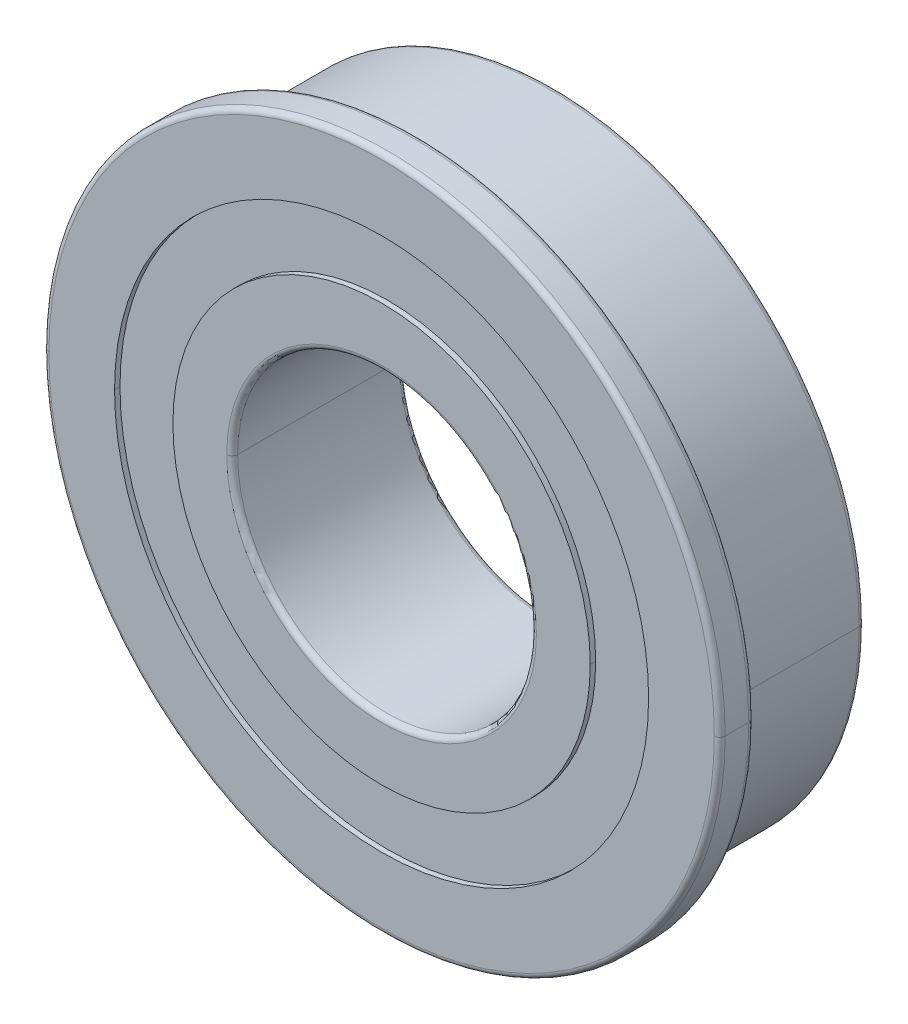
ISO-10303-21;
HEADER;
FILE_DESCRIPTION(('STEP AP214'),'2;1');
FILE_NAME('part.step','',(''),(''),'','','');
FILE_SCHEMA(('AUTOMOTIVE_DESIGN { 1 0 10303 214 1 1 1 1 }'));
ENDSEC;
DATA;
#1=APPLICATION_CONTEXT('core data for automotive mechanical design processes');
#2=APPLICATION_PROTOCOL_DEFINITION('international standard','automotive_design',2000,#1);
#3=PRODUCT_CONTEXT('',#1,'mechanical');
#4=PRODUCT('Part','Part','',(#3));
#5=PRODUCT_RELATED_PRODUCT_CATEGORY('part','',(#4));
#6=PRODUCT_DEFINITION_FORMATION('','',#4);
#7=PRODUCT_DEFINITION_CONTEXT('part definition',#1,'design');
#8=PRODUCT_DEFINITION('design','',#6,#7);
#9=PRODUCT_DEFINITION_SHAPE('','',#8);
#10=(LENGTH_UNIT() NAMED_UNIT(*) SI_UNIT(.MILLI.,.METRE.));
#11=(NAMED_UNIT(*) PLANE_ANGLE_UNIT() SI_UNIT($,.RADIAN.));
#12=(NAMED_UNIT(*) SI_UNIT($,.STERADIAN.) SOLID_ANGLE_UNIT());
#13=UNCERTAINTY_MEASURE_WITH_UNIT(LENGTH_MEASURE(1.E-05),#10,'distance_accuracy_value','');
#14=(GEOMETRIC_REPRESENTATION_CONTEXT(3) GLOBAL_UNCERTAINTY_ASSIGNED_CONTEXT((#13)) GLOBAL_UNIT_ASSIGNED_CONTEXT((#10,
#11,#12)) REPRESENTATION_CONTEXT('',''));
#15=CARTESIAN_POINT('',(0.,0.,0.));
#16=DIRECTION('',(0.,0.,1.));
#17=DIRECTION('',(1.,0.,0.));
#18=AXIS2_PLACEMENT_3D('',#15,#16,#17);
#19=CARTESIAN_POINT('',(0.,0.,3.71875));
#20=DIRECTION('',(0.,0.,-1.));
#21=DIRECTION('',(-1.,0.,0.));
#22=AXIS2_PLACEMENT_3D('',#19,#20,#21);
#23=TOROIDAL_SURFACE('',#22,15.31,0.25);
#24=CARTESIAN_POINT('',(15.31,0.,3.71875));
#25=DIRECTION('',(0.,1.,0.));
#26=DIRECTION('',(-1.,0.,0.));
#27=AXIS2_PLACEMENT_3D('',#24,#25,#26);
#28=CIRCLE('',#27,0.25);
#29=CARTESIAN_POINT('',(15.31,0.,3.96875));
#30=VERTEX_POINT('',#29);
#31=CARTESIAN_POINT('',(15.56,0.,3.71875));
#32=VERTEX_POINT('',#31);
#33=EDGE_CURVE('E416',#30,#32,#28,.T.);
#34=ORIENTED_EDGE('',*,*,#33,.F.);
#35=CARTESIAN_POINT('',(0.,0.,3.96875));
#36=DIRECTION('',(0.,0.,1.));
#37=DIRECTION('',(-1.,0.,0.));
#38=AXIS2_PLACEMENT_3D('',#35,#36,#37);
#39=CIRCLE('',#38,15.31);
#40=CARTESIAN_POINT('',(-15.31,0.,3.96875));
#41=VERTEX_POINT('',#40);
#42=EDGE_CURVE('E445',#41,#30,#39,.T.);
#43=ORIENTED_EDGE('',*,*,#42,.F.);
#44=CARTESIAN_POINT('',(-15.31,0.,3.71875));
#45=DIRECTION('',(0.,-1.,0.));
#46=DIRECTION('',(0.,0.,-1.));
#47=AXIS2_PLACEMENT_3D('',#44,#45,#46);
#48=CIRCLE('',#47,0.25);
#49=CARTESIAN_POINT('',(-15.56,0.,3.71875));
#50=VERTEX_POINT('',#49);
#51=EDGE_CURVE('E338',#41,#50,#48,.T.);
#52=ORIENTED_EDGE('',*,*,#51,.T.);
#53=CARTESIAN_POINT('',(0.,0.,3.71875));
#54=DIRECTION('',(0.,0.,-1.));
#55=DIRECTION('',(-1.,0.,0.));
#56=AXIS2_PLACEMENT_3D('',#53,#54,#55);
#57=CIRCLE('',#56,15.56);
#58=EDGE_CURVE('E204',#32,#50,#57,.T.);
#59=ORIENTED_EDGE('',*,*,#58,.F.);
#60=EDGE_LOOP('',(#34,#43,#52,#59));
#61=FACE_BOUND('',#60,.T.);
#62=ADVANCED_FACE('F15',(#61),#23,.T.);
#63=CARTESIAN_POINT('',(0.,0.,-3.71875));
#64=DIRECTION('',(0.,0.,1.));
#65=DIRECTION('',(1.,0.,0.));
#66=AXIS2_PLACEMENT_3D('',#63,#64,#65);
#67=TOROIDAL_SURFACE('',#66,14.0375,0.25);
#68=CARTESIAN_POINT('',(-14.0375,0.,-3.71875));
#69=DIRECTION('',(0.,1.,0.));
#70=DIRECTION('',(-1.,0.,0.));
#71=AXIS2_PLACEMENT_3D('',#68,#69,#70);
#72=CIRCLE('',#71,0.25);
#73=CARTESIAN_POINT('',(-14.0375,0.,-3.96875));
#74=VERTEX_POINT('',#73);
#75=CARTESIAN_POINT('',(-14.2875,0.,-3.71875));
#76=VERTEX_POINT('',#75);
#77=EDGE_CURVE('E278',#74,#76,#72,.T.);
#78=ORIENTED_EDGE('',*,*,#77,.F.);
#79=CARTESIAN_POINT('',(0.,0.,-3.96875));
#80=DIRECTION('',(0.,0.,-1.));
#81=DIRECTION('',(1.,0.,0.));
#82=AXIS2_PLACEMENT_3D('',#79,#80,#81);
#83=CIRCLE('',#82,14.0375);
#84=CARTESIAN_POINT('',(14.0375,0.,-3.96875));
#85=VERTEX_POINT('',#84);
#86=EDGE_CURVE('E191',#85,#74,#83,.T.);
#87=ORIENTED_EDGE('',*,*,#86,.F.);
#88=CARTESIAN_POINT('',(14.0375,0.,-3.71875));
#89=DIRECTION('',(0.,-1.,0.));
#90=DIRECTION('',(0.,0.,-1.));
#91=AXIS2_PLACEMENT_3D('',#88,#89,#90);
#92=CIRCLE('',#91,0.25);
#93=CARTESIAN_POINT('',(14.2875,0.,-3.71875));
#94=VERTEX_POINT('',#93);
#95=EDGE_CURVE('E277',#85,#94,#92,.T.);
#96=ORIENTED_EDGE('',*,*,#95,.T.);
#97=CARTESIAN_POINT('',(0.,0.,-3.71875));
#98=DIRECTION('',(0.,0.,1.));
#99=DIRECTION('',(1.,0.,0.));
#100=AXIS2_PLACEMENT_3D('',#97,#98,#99);
#101=CIRCLE('',#100,14.2875);
#102=EDGE_CURVE('E240',#76,#94,#101,.T.);
#103=ORIENTED_EDGE('',*,*,#102,.F.);
#104=EDGE_LOOP('',(#78,#87,#96,#103));
#105=FACE_BOUND('',#104,.T.);
#106=ADVANCED_FACE('F526',(#105),#67,.T.);
#107=CARTESIAN_POINT('',(0.,0.,2.63125));
#108=DIRECTION('',(0.,0.,1.));
#109=DIRECTION('',(1.,0.,0.));
#110=AXIS2_PLACEMENT_3D('',#107,#108,#109);
#111=TOROIDAL_SURFACE('',#110,15.31,0.25);
#112=CARTESIAN_POINT('',(-15.31,0.,2.63125));
#113=DIRECTION('',(0.,1.,0.));
#114=DIRECTION('',(-1.,0.,0.));
#115=AXIS2_PLACEMENT_3D('',#112,#113,#114);
#116=CIRCLE('',#115,0.25);
#117=CARTESIAN_POINT('',(-15.31,0.,2.38125));
#118=VERTEX_POINT('',#117);
#119=CARTESIAN_POINT('',(-15.56,0.,2.63125));
#120=VERTEX_POINT('',#119);
#121=EDGE_CURVE('E313',#118,#120,#116,.T.);
#122=ORIENTED_EDGE('',*,*,#121,.F.);
#123=CARTESIAN_POINT('',(0.,0.,2.38125));
#124=DIRECTION('',(0.,0.,-1.));
#125=DIRECTION('',(1.,0.,0.));
#126=AXIS2_PLACEMENT_3D('',#123,#124,#125);
#127=CIRCLE('',#126,15.31);
#128=CARTESIAN_POINT('',(15.31,0.,2.38125));
#129=VERTEX_POINT('',#128);
#130=EDGE_CURVE('E239',#129,#118,#127,.T.);
#131=ORIENTED_EDGE('',*,*,#130,.F.);
#132=CARTESIAN_POINT('',(15.31,0.,2.63125));
#133=DIRECTION('',(0.,-1.,0.));
#134=DIRECTION('',(0.,0.,-1.));
#135=AXIS2_PLACEMENT_3D('',#132,#133,#134);
#136=CIRCLE('',#135,0.25);
#137=CARTESIAN_POINT('',(15.56,0.,2.63125));
#138=VERTEX_POINT('',#137);
#139=EDGE_CURVE('E287',#129,#138,#136,.T.);
#140=ORIENTED_EDGE('',*,*,#139,.T.);
#141=CARTESIAN_POINT('',(0.,0.,2.63125));
#142=DIRECTION('',(0.,0.,1.));
#143=DIRECTION('',(1.,0.,0.));
#144=AXIS2_PLACEMENT_3D('',#141,#142,#143);
#145=CIRCLE('',#144,15.56);
#146=EDGE_CURVE('E323',#120,#138,#145,.T.);
#147=ORIENTED_EDGE('',*,*,#146,.F.);
#148=EDGE_LOOP('',(#122,#131,#140,#147));
#149=FACE_BOUND('',#148,.T.);
#150=ADVANCED_FACE('F531',(#149),#111,.T.);
#151=CARTESIAN_POINT('',(0.,0.,3.71875));
#152=DIRECTION('',(0.,0.,-1.));
#153=DIRECTION('',(-1.,0.,0.));
#154=AXIS2_PLACEMENT_3D('',#151,#152,#153);
#155=TOROIDAL_SURFACE('',#154,7.125,0.25);
#156=CARTESIAN_POINT('',(7.125,0.,3.71875));
#157=DIRECTION('',(0.,1.,0.));
#158=DIRECTION('',(-1.,0.,0.));
#159=AXIS2_PLACEMENT_3D('',#156,#157,#158);
#160=CIRCLE('',#159,0.25);
#161=CARTESIAN_POINT('',(6.875,0.,3.71875));
#162=VERTEX_POINT('',#161);
#163=CARTESIAN_POINT('',(7.125,0.,3.96875));
#164=VERTEX_POINT('',#163);
#165=EDGE_CURVE('E342',#162,#164,#160,.T.);
#166=ORIENTED_EDGE('',*,*,#165,.F.);
#167=CARTESIAN_POINT('',(0.,0.,3.71875));
#168=DIRECTION('',(0.,0.,1.));
#169=DIRECTION('',(-1.,0.,0.));
#170=AXIS2_PLACEMENT_3D('',#167,#168,#169);
#171=CIRCLE('',#170,6.875);
#172=CARTESIAN_POINT('',(-6.875,0.,3.71875));
#173=VERTEX_POINT('',#172);
#174=EDGE_CURVE('E302',#173,#162,#171,.T.);
#175=ORIENTED_EDGE('',*,*,#174,.F.);
#176=CARTESIAN_POINT('',(-7.125,0.,3.71875));
#177=DIRECTION('',(0.,-1.,0.));
#178=DIRECTION('',(0.,0.,-1.));
#179=AXIS2_PLACEMENT_3D('',#176,#177,#178);
#180=CIRCLE('',#179,0.25);
#181=CARTESIAN_POINT('',(-7.125,0.,3.96875));
#182=VERTEX_POINT('',#181);
#183=EDGE_CURVE('E269',#173,#182,#180,.T.);
#184=ORIENTED_EDGE('',*,*,#183,.T.);
#185=CARTESIAN_POINT('',(0.,0.,3.96875));
#186=DIRECTION('',(0.,0.,-1.));
#187=DIRECTION('',(-1.,0.,0.));
#188=AXIS2_PLACEMENT_3D('',#185,#186,#187);
#189=CIRCLE('',#188,7.125);
#190=EDGE_CURVE('E9',#164,#182,#189,.T.);
#191=ORIENTED_EDGE('',*,*,#190,.F.);
#192=EDGE_LOOP('',(#166,#175,#184,#191));
#193=FACE_BOUND('',#192,.T.);
#194=ADVANCED_FACE('F602',(#193),#155,.T.);
#195=CARTESIAN_POINT('',(0.,0.,-3.71875));
#196=DIRECTION('',(0.,0.,1.));
#197=DIRECTION('',(1.,0.,0.));
#198=AXIS2_PLACEMENT_3D('',#195,#196,#197);
#199=TOROIDAL_SURFACE('',#198,7.125,0.25);
#200=CARTESIAN_POINT('',(-7.125,0.,-3.71875));
#201=DIRECTION('',(0.,1.,0.));
#202=DIRECTION('',(-1.,0.,0.));
#203=AXIS2_PLACEMENT_3D('',#200,#201,#202);
#204=CIRCLE('',#203,0.25);
#205=CARTESIAN_POINT('',(-6.875,0.,-3.71875));
#206=VERTEX_POINT('',#205);
#207=CARTESIAN_POINT('',(-7.125,0.,-3.96875));
#208=VERTEX_POINT('',#207);
#209=EDGE_CURVE('E297',#206,#208,#204,.T.);
#210=ORIENTED_EDGE('',*,*,#209,.F.);
#211=CARTESIAN_POINT('',(0.,0.,-3.71875));
#212=DIRECTION('',(0.,0.,-1.));
#213=DIRECTION('',(1.,0.,0.));
#214=AXIS2_PLACEMENT_3D('',#211,#212,#213);
#215=CIRCLE('',#214,6.875);
#216=CARTESIAN_POINT('',(6.875,0.,-3.71875));
#217=VERTEX_POINT('',#216);
#218=EDGE_CURVE('E430',#217,#206,#215,.T.);
#219=ORIENTED_EDGE('',*,*,#218,.F.);
#220=CARTESIAN_POINT('',(7.125,0.,-3.71875));
#221=DIRECTION('',(0.,-1.,0.));
#222=DIRECTION('',(0.,0.,-1.));
#223=AXIS2_PLACEMENT_3D('',#220,#221,#222);
#224=CIRCLE('',#223,0.25);
#225=CARTESIAN_POINT('',(7.125,0.,-3.96875));
#226=VERTEX_POINT('',#225);
#227=EDGE_CURVE('E454',#217,#226,#224,.T.);
#228=ORIENTED_EDGE('',*,*,#227,.T.);
#229=CARTESIAN_POINT('',(0.,0.,-3.96875));
#230=DIRECTION('',(0.,0.,1.));
#231=DIRECTION('',(1.,0.,0.));
#232=AXIS2_PLACEMENT_3D('',#229,#230,#231);
#233=CIRCLE('',#232,7.125);
#234=EDGE_CURVE('E366',#208,#226,#233,.T.);
#235=ORIENTED_EDGE('',*,*,#234,.F.);
#236=EDGE_LOOP('',(#210,#219,#228,#235));
#237=FACE_BOUND('',#236,.T.);
#238=ADVANCED_FACE('F520',(#237),#199,.T.);
#239=CARTESIAN_POINT('',(0.,0.,53.2489151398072));
#240=DIRECTION('',(0.,0.,1.));
#241=DIRECTION('',(1.,0.,0.));
#242=AXIS2_PLACEMENT_3D('',#239,#240,#241);
#243=CYLINDRICAL_SURFACE('',#242,6.875);
#244=DIRECTION('',(0.,0.,1.));
#245=VECTOR('',#244,1.);
#246=CARTESIAN_POINT('',(-6.875,0.,53.2489151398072));
#247=LINE('',#246,#245);
#248=EDGE_CURVE('E420',#206,#173,#247,.T.);
#249=ORIENTED_EDGE('',*,*,#248,.F.);
#250=CARTESIAN_POINT('',(0.,0.,-3.71875));
#251=DIRECTION('',(0.,0.,-1.));
#252=DIRECTION('',(1.,0.,0.));
#253=AXIS2_PLACEMENT_3D('',#250,#251,#252);
#254=CIRCLE('',#253,6.875);
#255=EDGE_CURVE('E293',#206,#217,#254,.T.);
#256=ORIENTED_EDGE('',*,*,#255,.T.);
#257=DIRECTION('',(0.,0.,1.));
#258=VECTOR('',#257,1.);
#259=CARTESIAN_POINT('',(6.875,0.,53.2489151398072));
#260=LINE('',#259,#258);
#261=EDGE_CURVE('E298',#217,#162,#260,.T.);
#262=ORIENTED_EDGE('',*,*,#261,.T.);
#263=CARTESIAN_POINT('',(0.,0.,3.71875));
#264=DIRECTION('',(0.,0.,1.));
#265=DIRECTION('',(-1.,0.,0.));
#266=AXIS2_PLACEMENT_3D('',#263,#264,#265);
#267=CIRCLE('',#266,6.875);
#268=EDGE_CURVE('E291',#162,#173,#267,.T.);
#269=ORIENTED_EDGE('',*,*,#268,.T.);
#270=EDGE_LOOP('',(#249,#256,#262,#269));
#271=FACE_BOUND('',#270,.T.);
#272=ADVANCED_FACE('F511',(#271),#243,.F.);
#273=CARTESIAN_POINT('',(0.,9.602,3.96875));
#274=DIRECTION('',(0.,0.,-1.));
#275=DIRECTION('',(0.,-1.,0.));
#276=AXIS2_PLACEMENT_3D('',#273,#274,#275);
#277=PLANE('',#276);
#278=CARTESIAN_POINT('',(0.,0.,3.96875));
#279=DIRECTION('',(0.,0.,-1.));
#280=DIRECTION('',(-1.,0.,0.));
#281=AXIS2_PLACEMENT_3D('',#278,#279,#280);
#282=CIRCLE('',#281,7.125);
#283=EDGE_CURVE('E458',#182,#164,#282,.T.);
#284=ORIENTED_EDGE('',*,*,#283,.T.);
#285=ORIENTED_EDGE('',*,*,#190,.T.);
#286=EDGE_LOOP('',(#284,#285));
#287=FACE_BOUND('',#286,.T.);
#288=CARTESIAN_POINT('',(0.,0.,3.96875));
#289=DIRECTION('',(0.,0.,1.));
#290=DIRECTION('',(1.,0.,0.));
#291=AXIS2_PLACEMENT_3D('',#288,#289,#290);
#292=CIRCLE('',#291,9.602);
#293=CARTESIAN_POINT('',(9.602,0.,3.96875));
#294=VERTEX_POINT('',#293);
#295=CARTESIAN_POINT('',(-9.602,0.,3.96875));
#296=VERTEX_POINT('',#295);
#297=EDGE_CURVE('E328',#294,#296,#292,.T.);
#298=ORIENTED_EDGE('',*,*,#297,.T.);
#299=CARTESIAN_POINT('',(0.,0.,3.96875));
#300=DIRECTION('',(0.,0.,1.));
#301=DIRECTION('',(1.,0.,0.));
#302=AXIS2_PLACEMENT_3D('',#299,#300,#301);
#303=CIRCLE('',#302,9.602);
#304=EDGE_CURVE('E26',#296,#294,#303,.T.);
#305=ORIENTED_EDGE('',*,*,#304,.T.);
#306=EDGE_LOOP('',(#298,#305));
#307=FACE_BOUND('',#306,.T.);
#308=ADVANCED_FACE('F509',(#287,#307),#277,.F.);
#309=CARTESIAN_POINT('',(0.,0.,53.2489151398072));
#310=DIRECTION('',(0.,0.,1.));
#311=DIRECTION('',(1.,0.,0.));
#312=AXIS2_PLACEMENT_3D('',#309,#310,#311);
#313=CYLINDRICAL_SURFACE('',#312,9.602);
#314=DIRECTION('',(0.,0.,1.));
#315=VECTOR('',#314,1.);
#316=CARTESIAN_POINT('',(-9.602,0.,53.2489151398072));
#317=LINE('',#316,#315);
#318=CARTESIAN_POINT('',(-9.602,0.,3.71875));
#319=VERTEX_POINT('',#318);
#320=EDGE_CURVE('E324',#319,#296,#317,.T.);
#321=ORIENTED_EDGE('',*,*,#320,.F.);
#322=CARTESIAN_POINT('',(0.,0.,3.71875));
#323=DIRECTION('',(0.,0.,1.));
#324=DIRECTION('',(1.,0.,0.));
#325=AXIS2_PLACEMENT_3D('',#322,#323,#324);
#326=CIRCLE('',#325,9.602);
#327=CARTESIAN_POINT('',(9.602,0.,3.71875));
#328=VERTEX_POINT('',#327);
#329=EDGE_CURVE('E343',#319,#328,#326,.T.);
#330=ORIENTED_EDGE('',*,*,#329,.T.);
#331=DIRECTION('',(0.,0.,1.));
#332=VECTOR('',#331,1.);
#333=CARTESIAN_POINT('',(9.602,0.,53.2489151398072));
#334=LINE('',#333,#332);
#335=EDGE_CURVE('E283',#328,#294,#334,.T.);
#336=ORIENTED_EDGE('',*,*,#335,.T.);
#337=ORIENTED_EDGE('',*,*,#304,.F.);
#338=EDGE_LOOP('',(#321,#330,#336,#337));
#339=FACE_BOUND('',#338,.T.);
#340=ADVANCED_FACE('F507',(#339),#313,.T.);
#341=CARTESIAN_POINT('',(0.,12.2875,3.71875));
#342=DIRECTION('',(0.,0.,-1.));
#343=DIRECTION('',(0.,-1.,0.));
#344=AXIS2_PLACEMENT_3D('',#341,#342,#343);
#345=PLANE('',#344);
#346=CARTESIAN_POINT('',(0.,0.,3.71875));
#347=DIRECTION('',(0.,0.,1.));
#348=DIRECTION('',(1.,0.,0.));
#349=AXIS2_PLACEMENT_3D('',#346,#347,#348);
#350=CIRCLE('',#349,9.602);
#351=EDGE_CURVE('E301',#328,#319,#350,.T.);
#352=ORIENTED_EDGE('',*,*,#351,.F.);
#353=ORIENTED_EDGE('',*,*,#329,.F.);
#354=EDGE_LOOP('',(#352,#353));
#355=FACE_BOUND('',#354,.T.);
#356=CARTESIAN_POINT('',(0.,0.,3.71875));
#357=DIRECTION('',(0.,0.,1.));
#358=DIRECTION('',(1.,0.,0.));
#359=AXIS2_PLACEMENT_3D('',#356,#357,#358);
#360=CIRCLE('',#359,12.2875);
#361=CARTESIAN_POINT('',(12.2875,0.,3.71875));
#362=VERTEX_POINT('',#361);
#363=CARTESIAN_POINT('',(-12.2875,0.,3.71875));
#364=VERTEX_POINT('',#363);
#365=EDGE_CURVE('E347',#362,#364,#360,.T.);
#366=ORIENTED_EDGE('',*,*,#365,.T.);
#367=CARTESIAN_POINT('',(0.,0.,3.71875));
#368=DIRECTION('',(0.,0.,1.));
#369=DIRECTION('',(1.,0.,0.));
#370=AXIS2_PLACEMENT_3D('',#367,#368,#369);
#371=CIRCLE('',#370,12.2875);
#372=EDGE_CURVE('E279',#364,#362,#371,.T.);
#373=ORIENTED_EDGE('',*,*,#372,.T.);
#374=EDGE_LOOP('',(#366,#373));
#375=FACE_BOUND('',#374,.T.);
#376=ADVANCED_FACE('F502',(#355,#375),#345,.F.);
#377=CARTESIAN_POINT('',(0.,0.,53.2489151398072));
#378=DIRECTION('',(0.,0.,1.));
#379=DIRECTION('',(1.,0.,0.));
#380=AXIS2_PLACEMENT_3D('',#377,#378,#379);
#381=CYLINDRICAL_SURFACE('',#380,12.2875);
#382=DIRECTION('',(0.,0.,1.));
#383=VECTOR('',#382,1.);
#384=CARTESIAN_POINT('',(-12.2875,0.,53.2489151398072));
#385=LINE('',#384,#383);
#386=CARTESIAN_POINT('',(-12.2875,0.,3.96875));
#387=VERTEX_POINT('',#386);
#388=EDGE_CURVE('E282',#364,#387,#385,.T.);
#389=ORIENTED_EDGE('',*,*,#388,.F.);
#390=ORIENTED_EDGE('',*,*,#365,.F.);
#391=DIRECTION('',(0.,0.,1.));
#392=VECTOR('',#391,1.);
#393=CARTESIAN_POINT('',(12.2875,0.,53.2489151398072));
#394=LINE('',#393,#392);
#395=CARTESIAN_POINT('',(12.2875,0.,3.96875));
#396=VERTEX_POINT('',#395);
#397=EDGE_CURVE('E354',#362,#396,#394,.T.);
#398=ORIENTED_EDGE('',*,*,#397,.T.);
#399=CARTESIAN_POINT('',(0.,0.,3.96875));
#400=DIRECTION('',(0.,0.,1.));
#401=DIRECTION('',(1.,0.,0.));
#402=AXIS2_PLACEMENT_3D('',#399,#400,#401);
#403=CIRCLE('',#402,12.2875);
#404=EDGE_CURVE('E19',#396,#387,#403,.T.);
#405=ORIENTED_EDGE('',*,*,#404,.T.);
#406=EDGE_LOOP('',(#389,#390,#398,#405));
#407=FACE_BOUND('',#406,.T.);
#408=ADVANCED_FACE('F590',(#407),#381,.F.);
#409=CARTESIAN_POINT('',(0.,15.56,3.96875));
#410=DIRECTION('',(0.,0.,-1.));
#411=DIRECTION('',(0.,-1.,0.));
#412=AXIS2_PLACEMENT_3D('',#409,#410,#411);
#413=PLANE('',#412);
#414=ORIENTED_EDGE('',*,*,#404,.F.);
#415=CARTESIAN_POINT('',(0.,0.,3.96875));
#416=DIRECTION('',(0.,0.,1.));
#417=DIRECTION('',(1.,0.,0.));
#418=AXIS2_PLACEMENT_3D('',#415,#416,#417);
#419=CIRCLE('',#418,12.2875);
#420=EDGE_CURVE('E312',#387,#396,#419,.T.);
#421=ORIENTED_EDGE('',*,*,#420,.F.);
#422=EDGE_LOOP('',(#414,#421));
#423=FACE_BOUND('',#422,.T.);
#424=ORIENTED_EDGE('',*,*,#42,.T.);
#425=CARTESIAN_POINT('',(0.,0.,3.96875));
#426=DIRECTION('',(0.,0.,1.));
#427=DIRECTION('',(-1.,0.,0.));
#428=AXIS2_PLACEMENT_3D('',#425,#426,#427);
#429=CIRCLE('',#428,15.31);
#430=EDGE_CURVE('E377',#30,#41,#429,.T.);
#431=ORIENTED_EDGE('',*,*,#430,.T.);
#432=EDGE_LOOP('',(#424,#431));
#433=FACE_BOUND('',#432,.T.);
#434=ADVANCED_FACE('F586',(#423,#433),#413,.F.);
#435=CARTESIAN_POINT('',(0.,0.,53.2489151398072));
#436=DIRECTION('',(0.,0.,1.));
#437=DIRECTION('',(1.,0.,0.));
#438=AXIS2_PLACEMENT_3D('',#435,#436,#437);
#439=CYLINDRICAL_SURFACE('',#438,15.56);
#440=DIRECTION('',(0.,0.,1.));
#441=VECTOR('',#440,1.);
#442=CARTESIAN_POINT('',(-15.56,0.,53.2489151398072));
#443=LINE('',#442,#441);
#444=EDGE_CURVE('E382',#120,#50,#443,.T.);
#445=ORIENTED_EDGE('',*,*,#444,.F.);
#446=ORIENTED_EDGE('',*,*,#146,.T.);
#447=DIRECTION('',(0.,0.,1.));
#448=VECTOR('',#447,1.);
#449=CARTESIAN_POINT('',(15.56,0.,53.2489151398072));
#450=LINE('',#449,#448);
#451=EDGE_CURVE('E470',#138,#32,#450,.T.);
#452=ORIENTED_EDGE('',*,*,#451,.T.);
#453=ORIENTED_EDGE('',*,*,#58,.T.);
#454=EDGE_LOOP('',(#445,#446,#452,#453));
#455=FACE_BOUND('',#454,.T.);
#456=ADVANCED_FACE('F580',(#455),#439,.T.);
#457=CARTESIAN_POINT('',(0.,14.2875,2.38125));
#458=DIRECTION('',(0.,0.,1.));
#459=DIRECTION('',(1.,0.,0.));
#460=AXIS2_PLACEMENT_3D('',#457,#458,#459);
#461=PLANE('',#460);
#462=CARTESIAN_POINT('',(0.,0.,2.38125));
#463=DIRECTION('',(0.,0.,1.));
#464=DIRECTION('',(1.,0.,0.));
#465=AXIS2_PLACEMENT_3D('',#462,#463,#464);
#466=CIRCLE('',#465,14.2875);
#467=CARTESIAN_POINT('',(14.2875,0.,2.38125));
#468=VERTEX_POINT('',#467);
#469=CARTESIAN_POINT('',(-14.2875,0.,2.38125));
#470=VERTEX_POINT('',#469);
#471=EDGE_CURVE('E303',#468,#470,#466,.T.);
#472=ORIENTED_EDGE('',*,*,#471,.T.);
#473=CARTESIAN_POINT('',(0.,0.,2.38125));
#474=DIRECTION('',(0.,0.,1.));
#475=DIRECTION('',(1.,0.,0.));
#476=AXIS2_PLACEMENT_3D('',#473,#474,#475);
#477=CIRCLE('',#476,14.2875);
#478=EDGE_CURVE('E374',#470,#468,#477,.T.);
#479=ORIENTED_EDGE('',*,*,#478,.T.);
#480=EDGE_LOOP('',(#472,#479));
#481=FACE_BOUND('',#480,.T.);
#482=ORIENTED_EDGE('',*,*,#130,.T.);
#483=CARTESIAN_POINT('',(0.,0.,2.38125));
#484=DIRECTION('',(0.,0.,-1.));
#485=DIRECTION('',(1.,0.,0.));
#486=AXIS2_PLACEMENT_3D('',#483,#484,#485);
#487=CIRCLE('',#486,15.31);
#488=EDGE_CURVE('E317',#118,#129,#487,.T.);
#489=ORIENTED_EDGE('',*,*,#488,.T.);
#490=EDGE_LOOP('',(#482,#489));
#491=FACE_BOUND('',#490,.T.);
#492=ADVANCED_FACE('F576',(#481,#491),#461,.F.);
#493=CARTESIAN_POINT('',(0.,0.,2.13125));
#494=DIRECTION('',(0.,0.,1.));
#495=DIRECTION('',(1.,0.,0.));
#496=AXIS2_PLACEMENT_3D('',#493,#494,#495);
#497=TOROIDAL_SURFACE('',#496,14.2875,0.25);
#498=CARTESIAN_POINT('',(0.,0.,2.13125));
#499=DIRECTION('',(0.,0.,1.));
#500=DIRECTION('',(1.,0.,0.));
#501=AXIS2_PLACEMENT_3D('',#498,#499,#500);
#502=CIRCLE('',#501,14.0375);
#503=CARTESIAN_POINT('',(14.0375,0.,2.13125));
#504=VERTEX_POINT('',#503);
#505=CARTESIAN_POINT('',(-14.0375,0.,2.13125));
#506=VERTEX_POINT('',#505);
#507=EDGE_CURVE('E358',#504,#506,#502,.T.);
#508=ORIENTED_EDGE('',*,*,#507,.F.);
#509=CARTESIAN_POINT('',(14.2875,0.,2.13125));
#510=DIRECTION('',(0.,-1.,0.));
#511=DIRECTION('',(0.,0.,-1.));
#512=AXIS2_PLACEMENT_3D('',#509,#510,#511);
#513=CIRCLE('',#512,0.25);
#514=CARTESIAN_POINT('',(14.0709936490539,0.,2.00625));
#515=VERTEX_POINT('',#514);
#516=EDGE_CURVE('E273',#504,#515,#513,.T.);
#517=ORIENTED_EDGE('',*,*,#516,.T.);
#518=CARTESIAN_POINT('',(0.,0.,2.00625));
#519=DIRECTION('',(0.,0.,1.));
#520=DIRECTION('',(1.,0.,0.));
#521=AXIS2_PLACEMENT_3D('',#518,#519,#520);
#522=CIRCLE('',#521,14.0709936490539);
#523=CARTESIAN_POINT('',(-14.0709936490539,0.,2.00625));
#524=VERTEX_POINT('',#523);
#525=EDGE_CURVE('E265',#515,#524,#522,.T.);
#526=ORIENTED_EDGE('',*,*,#525,.T.);
#527=CARTESIAN_POINT('',(-14.2875,0.,2.13125));
#528=DIRECTION('',(0.,1.,0.));
#529=DIRECTION('',(-1.,0.,0.));
#530=AXIS2_PLACEMENT_3D('',#527,#528,#529);
#531=CIRCLE('',#530,0.25);
#532=EDGE_CURVE('E274',#506,#524,#531,.T.);
#533=ORIENTED_EDGE('',*,*,#532,.F.);
#534=EDGE_LOOP('',(#508,#517,#526,#533));
#535=FACE_BOUND('',#534,.T.);
#536=ADVANCED_FACE('F579',(#535),#497,.F.);
#537=CARTESIAN_POINT('',(0.,0.,1.63125));
#538=DIRECTION('',(0.,0.,-1.));
#539=DIRECTION('',(-1.,0.,0.));
#540=AXIS2_PLACEMENT_3D('',#537,#538,#539);
#541=CONICAL_SURFACE('',#540,14.2875,0.523598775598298);
#542=DIRECTION('',(0.5,0.,-0.86602540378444));
#543=VECTOR('',#542,1.);
#544=CARTESIAN_POINT('',(14.2875,0.,1.63125));
#545=LINE('',#544,#543);
#546=CARTESIAN_POINT('',(14.2875,0.,1.63125));
#547=VERTEX_POINT('',#546);
#548=EDGE_CURVE('E258',#515,#547,#545,.T.);
#549=ORIENTED_EDGE('',*,*,#548,.F.);
#550=CARTESIAN_POINT('',(0.,0.,2.00625));
#551=DIRECTION('',(0.,0.,1.));
#552=DIRECTION('',(1.,0.,0.));
#553=AXIS2_PLACEMENT_3D('',#550,#551,#552);
#554=CIRCLE('',#553,14.0709936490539);
#555=EDGE_CURVE('E254',#524,#515,#554,.T.);
#556=ORIENTED_EDGE('',*,*,#555,.F.);
#557=DIRECTION('',(-0.5,0.,-0.86602540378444));
#558=VECTOR('',#557,1.);
#559=CARTESIAN_POINT('',(-14.2875,0.,1.63125));
#560=LINE('',#559,#558);
#561=CARTESIAN_POINT('',(-14.2875,0.,1.63125));
#562=VERTEX_POINT('',#561);
#563=EDGE_CURVE('E145',#524,#562,#560,.T.);
#564=ORIENTED_EDGE('',*,*,#563,.T.);
#565=CARTESIAN_POINT('',(0.,0.,1.63125));
#566=DIRECTION('',(0.,0.,1.));
#567=DIRECTION('',(1.,0.,0.));
#568=AXIS2_PLACEMENT_3D('',#565,#566,#567);
#569=CIRCLE('',#568,14.2875);
#570=EDGE_CURVE('E229',#562,#547,#569,.T.);
#571=ORIENTED_EDGE('',*,*,#570,.T.);
#572=EDGE_LOOP('',(#549,#556,#564,#571));
#573=FACE_BOUND('',#572,.T.);
#574=ADVANCED_FACE('F252',(#573),#541,.T.);
#575=CARTESIAN_POINT('',(0.,0.,53.2489151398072));
#576=DIRECTION('',(0.,0.,1.));
#577=DIRECTION('',(1.,0.,0.));
#578=AXIS2_PLACEMENT_3D('',#575,#576,#577);
#579=CYLINDRICAL_SURFACE('',#578,14.2875);
#580=DIRECTION('',(0.,0.,1.));
#581=VECTOR('',#580,1.);
#582=CARTESIAN_POINT('',(-14.2875,0.,53.2489151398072));
#583=LINE('',#582,#581);
#584=EDGE_CURVE('E232',#76,#562,#583,.T.);
#585=ORIENTED_EDGE('',*,*,#584,.F.);
#586=ORIENTED_EDGE('',*,*,#102,.T.);
#587=DIRECTION('',(0.,0.,1.));
#588=VECTOR('',#587,1.);
#589=CARTESIAN_POINT('',(14.2875,0.,53.2489151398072));
#590=LINE('',#589,#588);
#591=EDGE_CURVE('E235',#94,#547,#590,.T.);
#592=ORIENTED_EDGE('',*,*,#591,.T.);
#593=ORIENTED_EDGE('',*,*,#570,.F.);
#594=EDGE_LOOP('',(#585,#586,#592,#593));
#595=FACE_BOUND('',#594,.T.);
#596=ADVANCED_FACE('F231',(#595),#579,.T.);
#597=CARTESIAN_POINT('',(0.,12.2875,-3.96875));
#598=DIRECTION('',(0.,0.,1.));
#599=DIRECTION('',(1.,0.,0.));
#600=AXIS2_PLACEMENT_3D('',#597,#598,#599);
#601=PLANE('',#600);
#602=CARTESIAN_POINT('',(0.,0.,-3.96875));
#603=DIRECTION('',(0.,0.,1.));
#604=DIRECTION('',(1.,0.,0.));
#605=AXIS2_PLACEMENT_3D('',#602,#603,#604);
#606=CIRCLE('',#605,12.2875);
#607=CARTESIAN_POINT('',(12.2875,0.,-3.96875));
#608=VERTEX_POINT('',#607);
#609=CARTESIAN_POINT('',(-12.2875,0.,-3.96875));
#610=VERTEX_POINT('',#609);
#611=EDGE_CURVE('E320',#608,#610,#606,.T.);
#612=ORIENTED_EDGE('',*,*,#611,.T.);
#613=CARTESIAN_POINT('',(0.,0.,-3.96875));
#614=DIRECTION('',(0.,0.,1.));
#615=DIRECTION('',(1.,0.,0.));
#616=AXIS2_PLACEMENT_3D('',#613,#614,#615);
#617=CIRCLE('',#616,12.2875);
#618=EDGE_CURVE('E395',#610,#608,#617,.T.);
#619=ORIENTED_EDGE('',*,*,#618,.T.);
#620=EDGE_LOOP('',(#612,#619));
#621=FACE_BOUND('',#620,.T.);
#622=ORIENTED_EDGE('',*,*,#86,.T.);
#623=CARTESIAN_POINT('',(0.,0.,-3.96875));
#624=DIRECTION('',(0.,0.,-1.));
#625=DIRECTION('',(1.,0.,0.));
#626=AXIS2_PLACEMENT_3D('',#623,#624,#625);
#627=CIRCLE('',#626,14.0375);
#628=EDGE_CURVE('E335',#74,#85,#627,.T.);
#629=ORIENTED_EDGE('',*,*,#628,.T.);
#630=EDGE_LOOP('',(#622,#629));
#631=FACE_BOUND('',#630,.T.);
#632=ADVANCED_FACE('F550',(#621,#631),#601,.F.);
#633=CARTESIAN_POINT('',(0.,0.,53.2489151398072));
#634=DIRECTION('',(0.,0.,1.));
#635=DIRECTION('',(1.,0.,0.));
#636=AXIS2_PLACEMENT_3D('',#633,#634,#635);
#637=CYLINDRICAL_SURFACE('',#636,12.2875);
#638=DIRECTION('',(0.,0.,1.));
#639=VECTOR('',#638,1.);
#640=CARTESIAN_POINT('',(-12.2875,0.,53.2489151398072));
#641=LINE('',#640,#639);
#642=CARTESIAN_POINT('',(-12.2875,0.,-3.71875));
#643=VERTEX_POINT('',#642);
#644=EDGE_CURVE('E334',#610,#643,#641,.T.);
#645=ORIENTED_EDGE('',*,*,#644,.F.);
#646=ORIENTED_EDGE('',*,*,#611,.F.);
#647=DIRECTION('',(0.,0.,1.));
#648=VECTOR('',#647,1.);
#649=CARTESIAN_POINT('',(12.2875,0.,53.2489151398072));
#650=LINE('',#649,#648);
#651=CARTESIAN_POINT('',(12.2875,0.,-3.71875));
#652=VERTEX_POINT('',#651);
#653=EDGE_CURVE('E333',#608,#652,#650,.T.);
#654=ORIENTED_EDGE('',*,*,#653,.T.);
#655=CARTESIAN_POINT('',(0.,0.,-3.71875));
#656=DIRECTION('',(0.,0.,1.));
#657=DIRECTION('',(1.,0.,0.));
#658=AXIS2_PLACEMENT_3D('',#655,#656,#657);
#659=CIRCLE('',#658,12.2875);
#660=EDGE_CURVE('E435',#652,#643,#659,.T.);
#661=ORIENTED_EDGE('',*,*,#660,.T.);
#662=EDGE_LOOP('',(#645,#646,#654,#661));
#663=FACE_BOUND('',#662,.T.);
#664=ADVANCED_FACE('F562',(#663),#637,.F.);
#665=CARTESIAN_POINT('',(0.,9.602,-3.71875));
#666=DIRECTION('',(0.,0.,1.));
#667=DIRECTION('',(1.,0.,0.));
#668=AXIS2_PLACEMENT_3D('',#665,#666,#667);
#669=PLANE('',#668);
#670=CARTESIAN_POINT('',(0.,0.,-3.71875));
#671=DIRECTION('',(0.,0.,1.));
#672=DIRECTION('',(1.,0.,0.));
#673=AXIS2_PLACEMENT_3D('',#670,#671,#672);
#674=CIRCLE('',#673,9.602);
#675=CARTESIAN_POINT('',(9.602,0.,-3.71875));
#676=VERTEX_POINT('',#675);
#677=CARTESIAN_POINT('',(-9.602,0.,-3.71875));
#678=VERTEX_POINT('',#677);
#679=EDGE_CURVE('E370',#676,#678,#674,.T.);
#680=ORIENTED_EDGE('',*,*,#679,.T.);
#681=CARTESIAN_POINT('',(0.,0.,-3.71875));
#682=DIRECTION('',(0.,0.,1.));
#683=DIRECTION('',(1.,0.,0.));
#684=AXIS2_PLACEMENT_3D('',#681,#682,#683);
#685=CIRCLE('',#684,9.602);
#686=EDGE_CURVE('E40',#678,#676,#685,.T.);
#687=ORIENTED_EDGE('',*,*,#686,.T.);
#688=EDGE_LOOP('',(#680,#687));
#689=FACE_BOUND('',#688,.T.);
#690=ORIENTED_EDGE('',*,*,#660,.F.);
#691=CARTESIAN_POINT('',(0.,0.,-3.71875));
#692=DIRECTION('',(0.,0.,1.));
#693=DIRECTION('',(1.,0.,0.));
#694=AXIS2_PLACEMENT_3D('',#691,#692,#693);
#695=CIRCLE('',#694,12.2875);
#696=EDGE_CURVE('E329',#643,#652,#695,.T.);
#697=ORIENTED_EDGE('',*,*,#696,.F.);
#698=EDGE_LOOP('',(#690,#697));
#699=FACE_BOUND('',#698,.T.);
#700=ADVANCED_FACE('F624',(#689,#699),#669,.F.);
#701=CARTESIAN_POINT('',(0.,0.,53.2489151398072));
#702=DIRECTION('',(0.,0.,1.));
#703=DIRECTION('',(1.,0.,0.));
#704=AXIS2_PLACEMENT_3D('',#701,#702,#703);
#705=CYLINDRICAL_SURFACE('',#704,9.602);
#706=DIRECTION('',(0.,0.,1.));
#707=VECTOR('',#706,1.);
#708=CARTESIAN_POINT('',(-9.602,0.,53.2489151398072));
#709=LINE('',#708,#707);
#710=CARTESIAN_POINT('',(-9.602,0.,-3.96875));
#711=VERTEX_POINT('',#710);
#712=EDGE_CURVE('E383',#711,#678,#709,.T.);
#713=ORIENTED_EDGE('',*,*,#712,.F.);
#714=CARTESIAN_POINT('',(0.,0.,-3.96875));
#715=DIRECTION('',(0.,0.,1.));
#716=DIRECTION('',(1.,0.,0.));
#717=AXIS2_PLACEMENT_3D('',#714,#715,#716);
#718=CIRCLE('',#717,9.602);
#719=CARTESIAN_POINT('',(9.602,0.,-3.96875));
#720=VERTEX_POINT('',#719);
#721=EDGE_CURVE('E363',#711,#720,#718,.T.);
#722=ORIENTED_EDGE('',*,*,#721,.T.);
#723=DIRECTION('',(0.,0.,1.));
#724=VECTOR('',#723,1.);
#725=CARTESIAN_POINT('',(9.602,0.,53.2489151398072));
#726=LINE('',#725,#724);
#727=EDGE_CURVE('E367',#720,#676,#726,.T.);
#728=ORIENTED_EDGE('',*,*,#727,.T.);
#729=ORIENTED_EDGE('',*,*,#686,.F.);
#730=EDGE_LOOP('',(#713,#722,#728,#729));
#731=FACE_BOUND('',#730,.T.);
#732=ADVANCED_FACE('F540',(#731),#705,.T.);
#733=CARTESIAN_POINT('',(0.,6.875,-3.96875));
#734=DIRECTION('',(0.,0.,1.));
#735=DIRECTION('',(1.,0.,0.));
#736=AXIS2_PLACEMENT_3D('',#733,#734,#735);
#737=PLANE('',#736);
#738=CARTESIAN_POINT('',(0.,0.,-3.96875));
#739=DIRECTION('',(0.,0.,1.));
#740=DIRECTION('',(1.,0.,0.));
#741=AXIS2_PLACEMENT_3D('',#738,#739,#740);
#742=CIRCLE('',#741,7.125);
#743=EDGE_CURVE('E426',#226,#208,#742,.T.);
#744=ORIENTED_EDGE('',*,*,#743,.T.);
#745=ORIENTED_EDGE('',*,*,#234,.T.);
#746=EDGE_LOOP('',(#744,#745));
#747=FACE_BOUND('',#746,.T.);
#748=CARTESIAN_POINT('',(0.,0.,-3.96875));
#749=DIRECTION('',(0.,0.,1.));
#750=DIRECTION('',(1.,0.,0.));
#751=AXIS2_PLACEMENT_3D('',#748,#749,#750);
#752=CIRCLE('',#751,9.602);
#753=EDGE_CURVE('E362',#720,#711,#752,.T.);
#754=ORIENTED_EDGE('',*,*,#753,.F.);
#755=ORIENTED_EDGE('',*,*,#721,.F.);
#756=EDGE_LOOP('',(#754,#755));
#757=FACE_BOUND('',#756,.T.);
#758=ADVANCED_FACE('F536',(#747,#757),#737,.F.);
#759=CARTESIAN_POINT('',(0.,0.,53.2489151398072));
#760=DIRECTION('',(0.,0.,1.));
#761=DIRECTION('',(1.,0.,0.));
#762=AXIS2_PLACEMENT_3D('',#759,#760,#761);
#763=CYLINDRICAL_SURFACE('',#762,9.602);
#764=ORIENTED_EDGE('',*,*,#753,.T.);
#765=ORIENTED_EDGE('',*,*,#712,.T.);
#766=ORIENTED_EDGE('',*,*,#679,.F.);
#767=ORIENTED_EDGE('',*,*,#727,.F.);
#768=EDGE_LOOP('',(#764,#765,#766,#767));
#769=FACE_BOUND('',#768,.T.);
#770=ADVANCED_FACE('F539',(#769),#763,.T.);
#771=CARTESIAN_POINT('',(0.,0.,53.2489151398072));
#772=DIRECTION('',(0.,0.,1.));
#773=DIRECTION('',(1.,0.,0.));
#774=AXIS2_PLACEMENT_3D('',#771,#772,#773);
#775=CYLINDRICAL_SURFACE('',#774,12.2875);
#776=ORIENTED_EDGE('',*,*,#618,.F.);
#777=ORIENTED_EDGE('',*,*,#644,.T.);
#778=ORIENTED_EDGE('',*,*,#696,.T.);
#779=ORIENTED_EDGE('',*,*,#653,.F.);
#780=EDGE_LOOP('',(#776,#777,#778,#779));
#781=FACE_BOUND('',#780,.T.);
#782=ADVANCED_FACE('F616',(#781),#775,.F.);
#783=CARTESIAN_POINT('',(0.,0.,53.2489151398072));
#784=DIRECTION('',(0.,0.,1.));
#785=DIRECTION('',(1.,0.,0.));
#786=AXIS2_PLACEMENT_3D('',#783,#784,#785);
#787=CYLINDRICAL_SURFACE('',#786,14.2875);
#788=CARTESIAN_POINT('',(0.,0.,-3.71875));
#789=DIRECTION('',(0.,0.,1.));
#790=DIRECTION('',(1.,0.,0.));
#791=AXIS2_PLACEMENT_3D('',#788,#789,#790);
#792=CIRCLE('',#791,14.2875);
#793=EDGE_CURVE('E247',#94,#76,#792,.T.);
#794=ORIENTED_EDGE('',*,*,#793,.T.);
#795=ORIENTED_EDGE('',*,*,#584,.T.);
#796=CARTESIAN_POINT('',(0.,0.,1.63125));
#797=DIRECTION('',(0.,0.,1.));
#798=DIRECTION('',(1.,0.,0.));
#799=AXIS2_PLACEMENT_3D('',#796,#797,#798);
#800=CIRCLE('',#799,14.2875);
#801=EDGE_CURVE('E244',#547,#562,#800,.T.);
#802=ORIENTED_EDGE('',*,*,#801,.F.);
#803=ORIENTED_EDGE('',*,*,#591,.F.);
#804=EDGE_LOOP('',(#794,#795,#802,#803));
#805=FACE_BOUND('',#804,.T.);
#806=ADVANCED_FACE('F243',(#805),#787,.T.);
#807=CARTESIAN_POINT('',(0.,0.,1.63125));
#808=DIRECTION('',(0.,0.,-1.));
#809=DIRECTION('',(-1.,0.,0.));
#810=AXIS2_PLACEMENT_3D('',#807,#808,#809);
#811=CONICAL_SURFACE('',#810,14.2875,0.523598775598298);
#812=ORIENTED_EDGE('',*,*,#525,.F.);
#813=ORIENTED_EDGE('',*,*,#548,.T.);
#814=ORIENTED_EDGE('',*,*,#801,.T.);
#815=ORIENTED_EDGE('',*,*,#563,.F.);
#816=EDGE_LOOP('',(#812,#813,#814,#815));
#817=FACE_BOUND('',#816,.T.);
#818=ADVANCED_FACE('F17',(#817),#811,.T.);
#819=CARTESIAN_POINT('',(0.,0.,2.13125));
#820=DIRECTION('',(0.,0.,1.));
#821=DIRECTION('',(1.,0.,0.));
#822=AXIS2_PLACEMENT_3D('',#819,#820,#821);
#823=TOROIDAL_SURFACE('',#822,14.2875,0.25);
#824=CARTESIAN_POINT('',(0.,0.,2.13125));
#825=DIRECTION('',(0.,0.,1.));
#826=DIRECTION('',(1.,0.,0.));
#827=AXIS2_PLACEMENT_3D('',#824,#825,#826);
#828=CIRCLE('',#827,14.0375);
#829=EDGE_CURVE('E307',#506,#504,#828,.T.);
#830=ORIENTED_EDGE('',*,*,#829,.F.);
#831=ORIENTED_EDGE('',*,*,#532,.T.);
#832=ORIENTED_EDGE('',*,*,#555,.T.);
#833=ORIENTED_EDGE('',*,*,#516,.F.);
#834=EDGE_LOOP('',(#830,#831,#832,#833));
#835=FACE_BOUND('',#834,.T.);
#836=ADVANCED_FACE('F558',(#835),#823,.F.);
#837=CARTESIAN_POINT('',(0.,0.,53.2489151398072));
#838=DIRECTION('',(0.,0.,1.));
#839=DIRECTION('',(1.,0.,0.));
#840=AXIS2_PLACEMENT_3D('',#837,#838,#839);
#841=CYLINDRICAL_SURFACE('',#840,15.56);
#842=CARTESIAN_POINT('',(0.,0.,2.63125));
#843=DIRECTION('',(0.,0.,1.));
#844=DIRECTION('',(1.,0.,0.));
#845=AXIS2_PLACEMENT_3D('',#842,#843,#844);
#846=CIRCLE('',#845,15.56);
#847=EDGE_CURVE('E292',#138,#120,#846,.T.);
#848=ORIENTED_EDGE('',*,*,#847,.T.);
#849=ORIENTED_EDGE('',*,*,#444,.T.);
#850=CARTESIAN_POINT('',(0.,0.,3.71875));
#851=DIRECTION('',(0.,0.,-1.));
#852=DIRECTION('',(-1.,0.,0.));
#853=AXIS2_PLACEMENT_3D('',#850,#851,#852);
#854=CIRCLE('',#853,15.56);
#855=EDGE_CURVE('E402',#50,#32,#854,.T.);
#856=ORIENTED_EDGE('',*,*,#855,.T.);
#857=ORIENTED_EDGE('',*,*,#451,.F.);
#858=EDGE_LOOP('',(#848,#849,#856,#857));
#859=FACE_BOUND('',#858,.T.);
#860=ADVANCED_FACE('F554',(#859),#841,.T.);
#861=CARTESIAN_POINT('',(0.,0.,53.2489151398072));
#862=DIRECTION('',(0.,0.,1.));
#863=DIRECTION('',(1.,0.,0.));
#864=AXIS2_PLACEMENT_3D('',#861,#862,#863);
#865=CYLINDRICAL_SURFACE('',#864,12.2875);
#866=ORIENTED_EDGE('',*,*,#372,.F.);
#867=ORIENTED_EDGE('',*,*,#388,.T.);
#868=ORIENTED_EDGE('',*,*,#420,.T.);
#869=ORIENTED_EDGE('',*,*,#397,.F.);
#870=EDGE_LOOP('',(#866,#867,#868,#869));
#871=FACE_BOUND('',#870,.T.);
#872=ADVANCED_FACE('F551',(#871),#865,.F.);
#873=CARTESIAN_POINT('',(0.,0.,53.2489151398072));
#874=DIRECTION('',(0.,0.,1.));
#875=DIRECTION('',(1.,0.,0.));
#876=AXIS2_PLACEMENT_3D('',#873,#874,#875);
#877=CYLINDRICAL_SURFACE('',#876,9.602);
#878=ORIENTED_EDGE('',*,*,#351,.T.);
#879=ORIENTED_EDGE('',*,*,#320,.T.);
#880=ORIENTED_EDGE('',*,*,#297,.F.);
#881=ORIENTED_EDGE('',*,*,#335,.F.);
#882=EDGE_LOOP('',(#878,#879,#880,#881));
#883=FACE_BOUND('',#882,.T.);
#884=ADVANCED_FACE('F495',(#883),#877,.T.);
#885=CARTESIAN_POINT('',(0.,0.,53.2489151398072));
#886=DIRECTION('',(0.,0.,1.));
#887=DIRECTION('',(1.,0.,0.));
#888=AXIS2_PLACEMENT_3D('',#885,#886,#887);
#889=CYLINDRICAL_SURFACE('',#888,6.875);
#890=ORIENTED_EDGE('',*,*,#218,.T.);
#891=ORIENTED_EDGE('',*,*,#248,.T.);
#892=ORIENTED_EDGE('',*,*,#174,.T.);
#893=ORIENTED_EDGE('',*,*,#261,.F.);
#894=EDGE_LOOP('',(#890,#891,#892,#893));
#895=FACE_BOUND('',#894,.T.);
#896=ADVANCED_FACE('F546',(#895),#889,.F.);
#897=CARTESIAN_POINT('',(0.,0.,-3.71875));
#898=DIRECTION('',(0.,0.,1.));
#899=DIRECTION('',(1.,0.,0.));
#900=AXIS2_PLACEMENT_3D('',#897,#898,#899);
#901=TOROIDAL_SURFACE('',#900,7.125,0.25);
#902=ORIENTED_EDGE('',*,*,#255,.F.);
#903=ORIENTED_EDGE('',*,*,#209,.T.);
#904=ORIENTED_EDGE('',*,*,#743,.F.);
#905=ORIENTED_EDGE('',*,*,#227,.F.);
#906=EDGE_LOOP('',(#902,#903,#904,#905));
#907=FACE_BOUND('',#906,.T.);
#908=ADVANCED_FACE('F542',(#907),#901,.T.);
#909=CARTESIAN_POINT('',(0.,0.,3.71875));
#910=DIRECTION('',(0.,0.,-1.));
#911=DIRECTION('',(-1.,0.,0.));
#912=AXIS2_PLACEMENT_3D('',#909,#910,#911);
#913=TOROIDAL_SURFACE('',#912,7.125,0.25);
#914=ORIENTED_EDGE('',*,*,#268,.F.);
#915=ORIENTED_EDGE('',*,*,#165,.T.);
#916=ORIENTED_EDGE('',*,*,#283,.F.);
#917=ORIENTED_EDGE('',*,*,#183,.F.);
#918=EDGE_LOOP('',(#914,#915,#916,#917));
#919=FACE_BOUND('',#918,.T.);
#920=ADVANCED_FACE('F545',(#919),#913,.T.);
#921=CARTESIAN_POINT('',(0.,0.,2.63125));
#922=DIRECTION('',(0.,0.,1.));
#923=DIRECTION('',(1.,0.,0.));
#924=AXIS2_PLACEMENT_3D('',#921,#922,#923);
#925=TOROIDAL_SURFACE('',#924,15.31,0.25);
#926=ORIENTED_EDGE('',*,*,#488,.F.);
#927=ORIENTED_EDGE('',*,*,#121,.T.);
#928=ORIENTED_EDGE('',*,*,#847,.F.);
#929=ORIENTED_EDGE('',*,*,#139,.F.);
#930=EDGE_LOOP('',(#926,#927,#928,#929));
#931=FACE_BOUND('',#930,.T.);
#932=ADVANCED_FACE('F598',(#931),#925,.T.);
#933=CARTESIAN_POINT('',(0.,0.,-3.71875));
#934=DIRECTION('',(0.,0.,1.));
#935=DIRECTION('',(1.,0.,0.));
#936=AXIS2_PLACEMENT_3D('',#933,#934,#935);
#937=TOROIDAL_SURFACE('',#936,14.0375,0.25);
#938=ORIENTED_EDGE('',*,*,#628,.F.);
#939=ORIENTED_EDGE('',*,*,#77,.T.);
#940=ORIENTED_EDGE('',*,*,#793,.F.);
#941=ORIENTED_EDGE('',*,*,#95,.F.);
#942=EDGE_LOOP('',(#938,#939,#940,#941));
#943=FACE_BOUND('',#942,.T.);
#944=ADVANCED_FACE('F574',(#943),#937,.T.);
#945=CARTESIAN_POINT('',(0.,0.,3.71875));
#946=DIRECTION('',(0.,0.,-1.));
#947=DIRECTION('',(-1.,0.,0.));
#948=AXIS2_PLACEMENT_3D('',#945,#946,#947);
#949=TOROIDAL_SURFACE('',#948,15.31,0.25);
#950=ORIENTED_EDGE('',*,*,#430,.F.);
#951=ORIENTED_EDGE('',*,*,#33,.T.);
#952=ORIENTED_EDGE('',*,*,#855,.F.);
#953=ORIENTED_EDGE('',*,*,#51,.F.);
#954=EDGE_LOOP('',(#950,#951,#952,#953));
#955=FACE_BOUND('',#954,.T.);
#956=ADVANCED_FACE('F568',(#955),#949,.T.);
#957=CARTESIAN_POINT('',(0.,0.,2.13125));
#958=DIRECTION('',(0.,0.,1.));
#959=DIRECTION('',(1.,0.,0.));
#960=AXIS2_PLACEMENT_3D('',#957,#958,#959);
#961=TOROIDAL_SURFACE('',#960,14.2875,0.25);
#962=CARTESIAN_POINT('',(-14.2875,0.,2.13125));
#963=DIRECTION('',(0.,1.,0.));
#964=DIRECTION('',(-1.,0.,0.));
#965=AXIS2_PLACEMENT_3D('',#962,#963,#964);
#966=CIRCLE('',#965,0.25);
#967=EDGE_CURVE('E308',#470,#506,#966,.T.);
#968=ORIENTED_EDGE('',*,*,#967,.T.);
#969=ORIENTED_EDGE('',*,*,#829,.T.);
#970=CARTESIAN_POINT('',(14.2875,0.,2.13125));
#971=DIRECTION('',(0.,-1.,0.));
#972=DIRECTION('',(0.,0.,-1.));
#973=AXIS2_PLACEMENT_3D('',#970,#971,#972);
#974=CIRCLE('',#973,0.25);
#975=EDGE_CURVE('E434',#468,#504,#974,.T.);
#976=ORIENTED_EDGE('',*,*,#975,.F.);
#977=ORIENTED_EDGE('',*,*,#478,.F.);
#978=EDGE_LOOP('',(#968,#969,#976,#977));
#979=FACE_BOUND('',#978,.T.);
#980=ADVANCED_FACE('F564',(#979),#961,.F.);
#981=CARTESIAN_POINT('',(0.,0.,2.13125));
#982=DIRECTION('',(0.,0.,1.));
#983=DIRECTION('',(1.,0.,0.));
#984=AXIS2_PLACEMENT_3D('',#981,#982,#983);
#985=TOROIDAL_SURFACE('',#984,14.2875,0.25);
#986=ORIENTED_EDGE('',*,*,#975,.T.);
#987=ORIENTED_EDGE('',*,*,#507,.T.);
#988=ORIENTED_EDGE('',*,*,#967,.F.);
#989=ORIENTED_EDGE('',*,*,#471,.F.);
#990=EDGE_LOOP('',(#986,#987,#988,#989));
#991=FACE_BOUND('',#990,.T.);
#992=ADVANCED_FACE('F567',(#991),#985,.F.);
#993=CLOSED_SHELL('',(#62,#106,#150,#194,#238,#272,#308,#340,#376,#408,#434,#456,#492,#536,#574,
#596,#632,#664,#700,#732,#758,#770,#782,#806,#818,#836,#860,#872,#884,#896,#908,#920,#932,#944,
#956,#980,#992));
#994=MANIFOLD_SOLID_BREP('B1',#993);
#995=ADVANCED_BREP_SHAPE_REPRESENTATION('',(#18,#994),#14);
#996=SHAPE_DEFINITION_REPRESENTATION(#9,#995);
ENDSEC;
END-ISO-10303-21;
